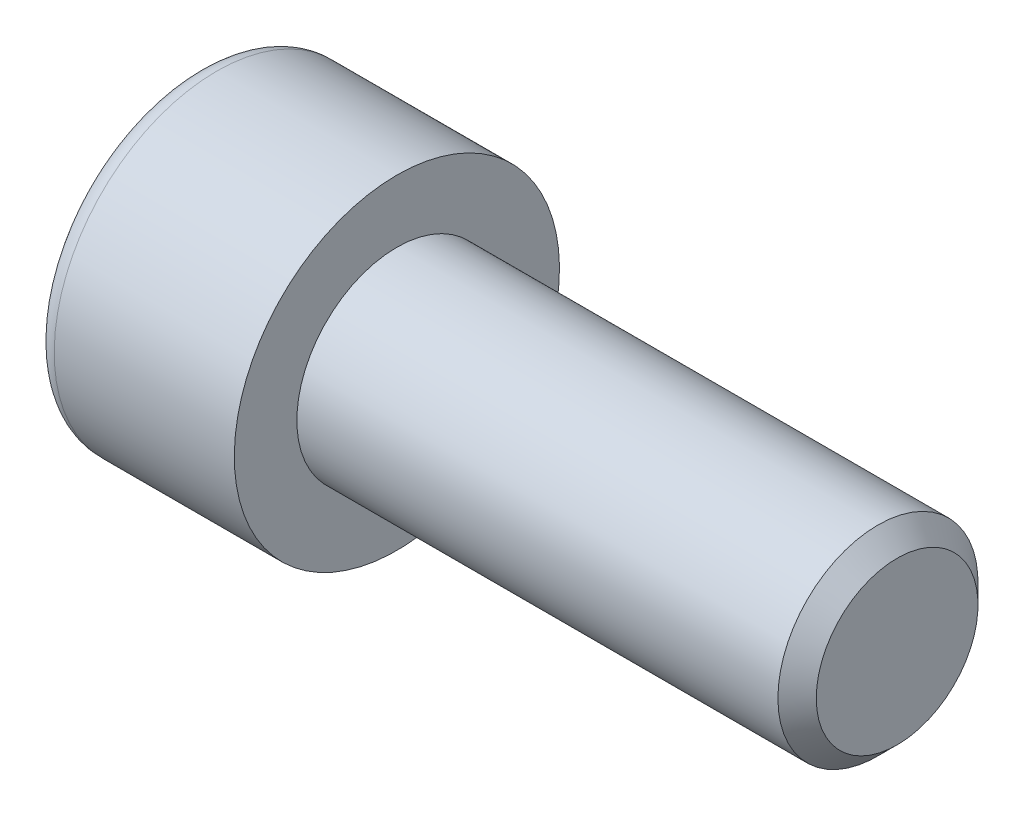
ISO-10303-21;
HEADER;
FILE_DESCRIPTION(('STEP AP214'),'2;1');
FILE_NAME('part.step','',(''),(''),'','','');
FILE_SCHEMA(('AUTOMOTIVE_DESIGN { 1 0 10303 214 1 1 1 1 }'));
ENDSEC;
DATA;
#1=APPLICATION_CONTEXT('core data for automotive mechanical design processes');
#2=APPLICATION_PROTOCOL_DEFINITION('international standard','automotive_design',2000,#1);
#3=PRODUCT_CONTEXT('',#1,'mechanical');
#4=PRODUCT('Part','Part','',(#3));
#5=PRODUCT_RELATED_PRODUCT_CATEGORY('part','',(#4));
#6=PRODUCT_DEFINITION_FORMATION('','',#4);
#7=PRODUCT_DEFINITION_CONTEXT('part definition',#1,'design');
#8=PRODUCT_DEFINITION('design','',#6,#7);
#9=PRODUCT_DEFINITION_SHAPE('','',#8);
#10=(LENGTH_UNIT() NAMED_UNIT(*) SI_UNIT(.MILLI.,.METRE.));
#11=(NAMED_UNIT(*) PLANE_ANGLE_UNIT() SI_UNIT($,.RADIAN.));
#12=(NAMED_UNIT(*) SI_UNIT($,.STERADIAN.) SOLID_ANGLE_UNIT());
#13=UNCERTAINTY_MEASURE_WITH_UNIT(LENGTH_MEASURE(1.E-05),#10,'distance_accuracy_value','');
#14=(GEOMETRIC_REPRESENTATION_CONTEXT(3) GLOBAL_UNCERTAINTY_ASSIGNED_CONTEXT((#13)) GLOBAL_UNIT_ASSIGNED_CONTEXT((#10,
#11,#12)) REPRESENTATION_CONTEXT('',''));
#15=CARTESIAN_POINT('',(0.,0.,0.));
#16=DIRECTION('',(0.,0.,1.));
#17=DIRECTION('',(1.,0.,0.));
#18=AXIS2_PLACEMENT_3D('',#15,#16,#17);
#19=CARTESIAN_POINT('',(-1.99999999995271,0.,0.));
#20=DIRECTION('',(-1.,0.,0.));
#21=DIRECTION('',(0.,0.,1.));
#22=AXIS2_PLACEMENT_3D('',#19,#20,#21);
#23=CONICAL_SURFACE('',#22,0.,1.04719755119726);
#24=CARTESIAN_POINT('',(-1.99999999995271,0.,0.));
#25=VERTEX_POINT('',#24);
#26=VERTEX_LOOP('',#25);
#27=FACE_BOUND('',#26,.T.);
#28=CARTESIAN_POINT('',(-3.99999999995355,1.16431272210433E-11,-3.46410161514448));
#29=CARTESIAN_POINT('',(-3.95604331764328,-0.1318318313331,-3.38798847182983));
#30=CARTESIAN_POINT('',(-3.91606701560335,-0.264801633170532,-3.3112183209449));
#31=CARTESIAN_POINT('',(-3.84628958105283,-0.533043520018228,-3.15634879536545));
#32=CARTESIAN_POINT('',(-3.81651313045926,-0.668320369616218,-3.07824666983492));
#33=CARTESIAN_POINT('',(-3.7701639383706,-0.937197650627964,-2.92301029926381));
#34=CARTESIAN_POINT('',(-3.75328268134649,-1.07075672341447,-2.84589993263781));
#35=CARTESIAN_POINT('',(-3.73313375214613,-1.33850298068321,-2.69131655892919));
#36=CARTESIAN_POINT('',(-3.72984939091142,-1.47268919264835,-2.61384411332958));
#37=CARTESIAN_POINT('',(-3.73669943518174,-1.72340173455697,-2.46909515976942));
#38=CARTESIAN_POINT('',(-3.74515192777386,-1.83996568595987,-2.40179693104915));
#39=CARTESIAN_POINT('',(-3.77193595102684,-2.0723342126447,-2.26763889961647));
#40=CARTESIAN_POINT('',(-3.79027662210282,-2.18813798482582,-2.20077956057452));
#41=CARTESIAN_POINT('',(-3.83612474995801,-2.4209852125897,-2.06634515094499));
#42=CARTESIAN_POINT('',(-3.86382646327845,-2.53799921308,-1.99878708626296));
#43=CARTESIAN_POINT('',(-3.92669764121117,-2.77028245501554,-1.86467829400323));
#44=CARTESIAN_POINT('',(-3.96185234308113,-2.88555466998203,-1.79812584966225));
#45=CARTESIAN_POINT('',(-3.99999999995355,-3.00000000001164,-1.73205080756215));
#46=B_SPLINE_CURVE_WITH_KNOTS('',3,(#28,#29,#30,#31,#32,#33,#34,#35,#36,#37,#38,#39,#40,#41,#42,
#43,#44,#45),.UNSPECIFIED.,.F.,.F.,(4,2,2,2,2,2,2,2,4),(0.,0.475524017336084,0.952190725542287,
1.41706140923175,1.88136133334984,2.28556167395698,2.69013629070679,3.10368243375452,
3.51641696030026),.UNSPECIFIED.);
#47=CARTESIAN_POINT('',(-3.99999999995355,0.,-3.46410161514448));
#48=VERTEX_POINT('',#47);
#49=CARTESIAN_POINT('',(-3.99999999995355,-3.00000000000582,-1.73205080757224));
#50=VERTEX_POINT('',#49);
#51=EDGE_CURVE('E111',#48,#50,#46,.T.);
#52=ORIENTED_EDGE('',*,*,#51,.T.);
#53=CARTESIAN_POINT('',(-3.99999999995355,-3.,-1.73205080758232));
#54=CARTESIAN_POINT('',(-3.95895066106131,-3.,-1.58986661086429));
#55=CARTESIAN_POINT('',(-3.92136883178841,-3.,-1.44655761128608));
#56=CARTESIAN_POINT('',(-3.85494761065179,-3.,-1.15761165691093));
#57=CARTESIAN_POINT('',(-3.82612777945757,-3.,-1.01197024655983));
#58=CARTESIAN_POINT('',(-3.77978200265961,-3.,-0.722321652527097));
#59=CARTESIAN_POINT('',(-3.76200896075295,-3.,-0.57835524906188));
#60=CARTESIAN_POINT('',(-3.73814970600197,-3.,-0.289591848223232));
#61=CARTESIAN_POINT('',(-3.73205080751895,-3.,-0.144795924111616));
#62=CARTESIAN_POINT('',(-3.73205080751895,-3.,0.144795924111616));
#63=CARTESIAN_POINT('',(-3.73814970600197,-3.,0.289591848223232));
#64=CARTESIAN_POINT('',(-3.76200896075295,-3.,0.57835524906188));
#65=CARTESIAN_POINT('',(-3.77978200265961,-3.,0.722321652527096));
#66=CARTESIAN_POINT('',(-3.82612777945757,-3.,1.01197024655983));
#67=CARTESIAN_POINT('',(-3.85494761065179,-3.,1.15761165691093));
#68=CARTESIAN_POINT('',(-3.92136883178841,-3.,1.44655761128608));
#69=CARTESIAN_POINT('',(-3.95895066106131,-3.,1.58986661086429));
#70=CARTESIAN_POINT('',(-3.99999999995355,-3.,1.73205080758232));
#71=B_SPLINE_CURVE_WITH_KNOTS('',3,(#53,#54,#55,#56,#57,#58,#59,#60,#61,#62,#63,#64,#65,#66,#67,
#68,#69,#70),.UNSPECIFIED.,.F.,.F.,(4,2,2,2,2,2,2,2,4),(0.,0.444110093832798,0.88920447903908,
1.32394628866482,1.7582154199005,2.19248455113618,2.62722636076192,3.07232074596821,
3.516430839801),.UNSPECIFIED.);
#72=CARTESIAN_POINT('',(-3.99999999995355,-3.00000000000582,1.73205080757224));
#73=VERTEX_POINT('',#72);
#74=EDGE_CURVE('E106',#50,#73,#71,.T.);
#75=ORIENTED_EDGE('',*,*,#74,.T.);
#76=CARTESIAN_POINT('',(-3.99999999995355,-3.00000000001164,1.73205080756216));
#77=CARTESIAN_POINT('',(-3.95604331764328,-2.8681681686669,1.8081639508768));
#78=CARTESIAN_POINT('',(-3.91606701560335,-2.73519836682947,1.88493410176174));
#79=CARTESIAN_POINT('',(-3.84628958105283,-2.46695647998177,2.03980362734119));
#80=CARTESIAN_POINT('',(-3.81651313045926,-2.33167963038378,2.11790575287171));
#81=CARTESIAN_POINT('',(-3.7701639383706,-2.06280234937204,2.27314212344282));
#82=CARTESIAN_POINT('',(-3.75328268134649,-1.92924327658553,2.35025249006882));
#83=CARTESIAN_POINT('',(-3.73313375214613,-1.6614970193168,2.50483586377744));
#84=CARTESIAN_POINT('',(-3.72984939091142,-1.52731080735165,2.58230830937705));
#85=CARTESIAN_POINT('',(-3.73669943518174,-1.27659826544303,2.72705726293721));
#86=CARTESIAN_POINT('',(-3.74515192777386,-1.16003431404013,2.79435549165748));
#87=CARTESIAN_POINT('',(-3.77193595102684,-0.927665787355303,2.92851352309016));
#88=CARTESIAN_POINT('',(-3.79027662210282,-0.811862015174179,2.99537286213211));
#89=CARTESIAN_POINT('',(-3.83612474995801,-0.5790147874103,3.12980727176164));
#90=CARTESIAN_POINT('',(-3.86382646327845,-0.462000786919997,3.19736533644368));
#91=CARTESIAN_POINT('',(-3.92669764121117,-0.22971754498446,3.3314741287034));
#92=CARTESIAN_POINT('',(-3.96185234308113,-0.114445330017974,3.39802657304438));
#93=CARTESIAN_POINT('',(-3.99999999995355,1.16435634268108E-11,3.46410161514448));
#94=B_SPLINE_CURVE_WITH_KNOTS('',3,(#76,#77,#78,#79,#80,#81,#82,#83,#84,#85,#86,#87,#88,#89,#90,
#91,#92,#93),.UNSPECIFIED.,.F.,.F.,(4,2,2,2,2,2,2,2,4),(0.,0.475524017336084,0.952190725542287,
1.41706140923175,1.88136133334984,2.28556167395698,2.69013629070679,3.10368243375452,
3.51641696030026),.UNSPECIFIED.);
#95=CARTESIAN_POINT('',(-3.99999999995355,0.,3.46410161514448));
#96=VERTEX_POINT('',#95);
#97=EDGE_CURVE('E89',#73,#96,#94,.T.);
#98=ORIENTED_EDGE('',*,*,#97,.T.);
#99=CARTESIAN_POINT('',(-3.99999999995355,-1.1643732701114E-11,3.46410161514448));
#100=CARTESIAN_POINT('',(-3.95604331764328,0.131831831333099,3.38798847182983));
#101=CARTESIAN_POINT('',(-3.91606701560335,0.264801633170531,3.3112183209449));
#102=CARTESIAN_POINT('',(-3.84628958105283,0.533043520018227,3.15634879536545));
#103=CARTESIAN_POINT('',(-3.81651313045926,0.668320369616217,3.07824666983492));
#104=CARTESIAN_POINT('',(-3.7701639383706,0.937197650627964,2.92301029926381));
#105=CARTESIAN_POINT('',(-3.75328268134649,1.07075672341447,2.84589993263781));
#106=CARTESIAN_POINT('',(-3.73313375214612,1.3385029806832,2.69131655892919));
#107=CARTESIAN_POINT('',(-3.72984939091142,1.47268919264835,2.61384411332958));
#108=CARTESIAN_POINT('',(-3.73669943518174,1.72340173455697,2.46909515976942));
#109=CARTESIAN_POINT('',(-3.74515192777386,1.83996568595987,2.40179693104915));
#110=CARTESIAN_POINT('',(-3.77193595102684,2.0723342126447,2.26763889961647));
#111=CARTESIAN_POINT('',(-3.79027662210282,2.18813798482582,2.20077956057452));
#112=CARTESIAN_POINT('',(-3.83612474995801,2.4209852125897,2.06634515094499));
#113=CARTESIAN_POINT('',(-3.86382646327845,2.53799921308,1.99878708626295));
#114=CARTESIAN_POINT('',(-3.92669764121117,2.77028245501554,1.86467829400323));
#115=CARTESIAN_POINT('',(-3.96185234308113,2.88555466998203,1.79812584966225));
#116=CARTESIAN_POINT('',(-3.99999999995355,3.00000000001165,1.73205080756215));
#117=B_SPLINE_CURVE_WITH_KNOTS('',3,(#99,#100,#101,#102,#103,#104,#105,#106,#107,#108,#109,#110,
#111,#112,#113,#114,#115,#116),.UNSPECIFIED.,.F.,.F.,(4,2,2,2,2,2,2,2,4),(0.,0.475524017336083,
0.952190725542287,1.41706140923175,1.88136133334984,2.28556167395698,2.69013629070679,
3.10368243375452,3.51641696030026),.UNSPECIFIED.);
#118=CARTESIAN_POINT('',(-3.99999999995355,3.00000000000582,1.73205080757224));
#119=VERTEX_POINT('',#118);
#120=EDGE_CURVE('E86',#96,#119,#117,.T.);
#121=ORIENTED_EDGE('',*,*,#120,.T.);
#122=CARTESIAN_POINT('',(-3.99999999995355,3.,1.73205080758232));
#123=CARTESIAN_POINT('',(-3.95895066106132,3.,1.58986661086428));
#124=CARTESIAN_POINT('',(-3.92136883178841,3.,1.44655761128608));
#125=CARTESIAN_POINT('',(-3.85494761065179,3.,1.15761165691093));
#126=CARTESIAN_POINT('',(-3.82612777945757,3.,1.01197024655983));
#127=CARTESIAN_POINT('',(-3.77978200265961,3.,0.722321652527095));
#128=CARTESIAN_POINT('',(-3.76200896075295,3.,0.578355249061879));
#129=CARTESIAN_POINT('',(-3.73814970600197,3.,0.289591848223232));
#130=CARTESIAN_POINT('',(-3.73205080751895,3.,0.144795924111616));
#131=CARTESIAN_POINT('',(-3.73205080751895,3.,-0.144795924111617));
#132=CARTESIAN_POINT('',(-3.73814970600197,3.,-0.289591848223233));
#133=CARTESIAN_POINT('',(-3.76200896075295,3.,-0.578355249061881));
#134=CARTESIAN_POINT('',(-3.77978200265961,3.,-0.722321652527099));
#135=CARTESIAN_POINT('',(-3.82612777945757,3.,-1.01197024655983));
#136=CARTESIAN_POINT('',(-3.85494761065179,3.,-1.15761165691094));
#137=CARTESIAN_POINT('',(-3.92136883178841,3.,-1.44655761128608));
#138=CARTESIAN_POINT('',(-3.95895066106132,3.,-1.58986661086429));
#139=CARTESIAN_POINT('',(-3.99999999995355,3.,-1.73205080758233));
#140=B_SPLINE_CURVE_WITH_KNOTS('',3,(#122,#123,#124,#125,#126,#127,#128,#129,#130,#131,#132,
#133,#134,#135,#136,#137,#138,#139),.UNSPECIFIED.,.F.,.F.,(4,2,2,2,2,2,2,2,4),(0.,
0.444110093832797,0.889204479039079,1.32394628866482,1.7582154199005,2.19248455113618,
2.62722636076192,3.07232074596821,3.51643083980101),.UNSPECIFIED.);
#141=CARTESIAN_POINT('',(-3.99999999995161,3.,-1.7320508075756));
#142=VERTEX_POINT('',#141);
#143=EDGE_CURVE('E20',#119,#142,#140,.T.);
#144=ORIENTED_EDGE('',*,*,#143,.T.);
#145=CARTESIAN_POINT('',(-3.99999999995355,3.00000000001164,-1.73205080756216));
#146=CARTESIAN_POINT('',(-3.95604331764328,2.8681681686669,-1.80816395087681));
#147=CARTESIAN_POINT('',(-3.91606701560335,2.73519836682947,-1.88493410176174));
#148=CARTESIAN_POINT('',(-3.84628958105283,2.46695647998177,-2.03980362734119));
#149=CARTESIAN_POINT('',(-3.81651313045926,2.33167963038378,-2.11790575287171));
#150=CARTESIAN_POINT('',(-3.7701639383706,2.06280234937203,-2.27314212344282));
#151=CARTESIAN_POINT('',(-3.75328268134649,1.92924327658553,-2.35025249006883));
#152=CARTESIAN_POINT('',(-3.73313375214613,1.66149701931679,-2.50483586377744));
#153=CARTESIAN_POINT('',(-3.72984939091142,1.52731080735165,-2.58230830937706));
#154=CARTESIAN_POINT('',(-3.73669943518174,1.27659826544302,-2.72705726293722));
#155=CARTESIAN_POINT('',(-3.74515192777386,1.16003431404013,-2.79435549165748));
#156=CARTESIAN_POINT('',(-3.77193595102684,0.927665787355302,-2.92851352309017));
#157=CARTESIAN_POINT('',(-3.79027662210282,0.811862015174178,-2.99537286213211));
#158=CARTESIAN_POINT('',(-3.83612474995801,0.5790147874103,-3.12980727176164));
#159=CARTESIAN_POINT('',(-3.86382646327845,0.462000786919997,-3.19736533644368));
#160=CARTESIAN_POINT('',(-3.92669764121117,0.229717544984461,-3.3314741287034));
#161=CARTESIAN_POINT('',(-3.96185234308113,0.114445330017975,-3.39802657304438));
#162=CARTESIAN_POINT('',(-3.99999999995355,-1.1642871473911E-11,-3.46410161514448));
#163=B_SPLINE_CURVE_WITH_KNOTS('',3,(#145,#146,#147,#148,#149,#150,#151,#152,#153,#154,#155,
#156,#157,#158,#159,#160,#161,#162),.UNSPECIFIED.,.F.,.F.,(4,2,2,2,2,2,2,2,4),(0.,
0.475524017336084,0.952190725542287,1.41706140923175,1.88136133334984,2.28556167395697,
2.69013629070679,3.10368243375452,3.51641696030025),.UNSPECIFIED.);
#164=EDGE_CURVE('E115',#142,#48,#163,.T.);
#165=ORIENTED_EDGE('',*,*,#164,.T.);
#166=EDGE_LOOP('',(#52,#75,#98,#121,#144,#165));
#167=FACE_BOUND('',#166,.T.);
#168=ADVANCED_FACE('F16',(#27,#167),#23,.F.);
#169=CARTESIAN_POINT('',(-8.,3.,1.73205080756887));
#170=DIRECTION('',(0.,1.,0.));
#171=DIRECTION('',(0.,0.,1.));
#172=AXIS2_PLACEMENT_3D('',#169,#170,#171);
#173=PLANE('',#172);
#174=DIRECTION('',(1.,0.,0.));
#175=VECTOR('',#174,1.);
#176=CARTESIAN_POINT('',(-8.,3.,1.73205080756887));
#177=LINE('',#176,#175);
#178=CARTESIAN_POINT('',(-8.,3.,1.73205080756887));
#179=VERTEX_POINT('',#178);
#180=EDGE_CURVE('E78',#119,#179,#177,.F.);
#181=ORIENTED_EDGE('',*,*,#180,.T.);
#182=DIRECTION('',(0.,0.,1.));
#183=VECTOR('',#182,1.);
#184=CARTESIAN_POINT('',(-8.,3.,0.));
#185=LINE('',#184,#183);
#186=CARTESIAN_POINT('',(-8.,3.,-1.73205080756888));
#187=VERTEX_POINT('',#186);
#188=EDGE_CURVE('E158',#187,#179,#185,.T.);
#189=ORIENTED_EDGE('',*,*,#188,.F.);
#190=DIRECTION('',(1.,0.,0.));
#191=VECTOR('',#190,1.);
#192=CARTESIAN_POINT('',(-8.,3.,-1.73205080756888));
#193=LINE('',#192,#191);
#194=EDGE_CURVE('E81',#187,#142,#193,.T.);
#195=ORIENTED_EDGE('',*,*,#194,.T.);
#196=ORIENTED_EDGE('',*,*,#143,.F.);
#197=EDGE_LOOP('',(#181,#189,#195,#196));
#198=FACE_BOUND('',#197,.T.);
#199=ADVANCED_FACE('F75',(#198),#173,.F.);
#200=CARTESIAN_POINT('',(-8.,0.,3.46410161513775));
#201=DIRECTION('',(0.,0.5,0.866025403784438));
#202=DIRECTION('',(0.,-0.866025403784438,0.5));
#203=AXIS2_PLACEMENT_3D('',#200,#201,#202);
#204=PLANE('',#203);
#205=DIRECTION('',(1.,0.,0.));
#206=VECTOR('',#205,1.);
#207=CARTESIAN_POINT('',(-8.,0.,3.46410161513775));
#208=LINE('',#207,#206);
#209=CARTESIAN_POINT('',(-8.,0.,3.46410161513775));
#210=VERTEX_POINT('',#209);
#211=EDGE_CURVE('E92',#96,#210,#208,.F.);
#212=ORIENTED_EDGE('',*,*,#211,.T.);
#213=DIRECTION('',(0.,-0.866025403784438,0.500000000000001));
#214=VECTOR('',#213,1.);
#215=CARTESIAN_POINT('',(-8.,3.,1.73205080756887));
#216=LINE('',#215,#214);
#217=EDGE_CURVE('E95',#179,#210,#216,.T.);
#218=ORIENTED_EDGE('',*,*,#217,.F.);
#219=ORIENTED_EDGE('',*,*,#180,.F.);
#220=ORIENTED_EDGE('',*,*,#120,.F.);
#221=EDGE_LOOP('',(#212,#218,#219,#220));
#222=FACE_BOUND('',#221,.T.);
#223=ADVANCED_FACE('F93',(#222),#204,.F.);
#224=CARTESIAN_POINT('',(-8.,-3.,1.73205080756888));
#225=DIRECTION('',(0.,-0.5,0.866025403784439));
#226=DIRECTION('',(0.,-0.866025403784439,-0.5));
#227=AXIS2_PLACEMENT_3D('',#224,#225,#226);
#228=PLANE('',#227);
#229=DIRECTION('',(1.,0.,0.));
#230=VECTOR('',#229,1.);
#231=CARTESIAN_POINT('',(-8.,-3.,1.73205080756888));
#232=LINE('',#231,#230);
#233=CARTESIAN_POINT('',(-8.,-3.,1.73205080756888));
#234=VERTEX_POINT('',#233);
#235=EDGE_CURVE('E104',#73,#234,#232,.F.);
#236=ORIENTED_EDGE('',*,*,#235,.T.);
#237=DIRECTION('',(0.,-0.866025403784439,-0.5));
#238=VECTOR('',#237,1.);
#239=CARTESIAN_POINT('',(-8.,0.,3.46410161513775));
#240=LINE('',#239,#238);
#241=EDGE_CURVE('E180',#210,#234,#240,.T.);
#242=ORIENTED_EDGE('',*,*,#241,.F.);
#243=ORIENTED_EDGE('',*,*,#211,.F.);
#244=ORIENTED_EDGE('',*,*,#97,.F.);
#245=EDGE_LOOP('',(#236,#242,#243,#244));
#246=FACE_BOUND('',#245,.T.);
#247=ADVANCED_FACE('F229',(#246),#228,.F.);
#248=CARTESIAN_POINT('',(-8.,-3.,-1.73205080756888));
#249=DIRECTION('',(0.,-1.,0.));
#250=DIRECTION('',(0.,0.,-1.));
#251=AXIS2_PLACEMENT_3D('',#248,#249,#250);
#252=PLANE('',#251);
#253=DIRECTION('',(1.,0.,0.));
#254=VECTOR('',#253,1.);
#255=CARTESIAN_POINT('',(-8.,-3.,-1.73205080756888));
#256=LINE('',#255,#254);
#257=CARTESIAN_POINT('',(-8.,-3.,-1.73205080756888));
#258=VERTEX_POINT('',#257);
#259=EDGE_CURVE('E109',#50,#258,#256,.F.);
#260=ORIENTED_EDGE('',*,*,#259,.T.);
#261=DIRECTION('',(0.,0.,1.));
#262=VECTOR('',#261,1.);
#263=CARTESIAN_POINT('',(-8.,-3.,0.));
#264=LINE('',#263,#262);
#265=EDGE_CURVE('E175',#234,#258,#264,.F.);
#266=ORIENTED_EDGE('',*,*,#265,.F.);
#267=ORIENTED_EDGE('',*,*,#235,.F.);
#268=ORIENTED_EDGE('',*,*,#74,.F.);
#269=EDGE_LOOP('',(#260,#266,#267,#268));
#270=FACE_BOUND('',#269,.T.);
#271=ADVANCED_FACE('F232',(#270),#252,.F.);
#272=CARTESIAN_POINT('',(-8.,0.,-3.46410161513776));
#273=DIRECTION('',(0.,-0.5,-0.866025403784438));
#274=DIRECTION('',(0.,0.866025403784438,-0.5));
#275=AXIS2_PLACEMENT_3D('',#272,#273,#274);
#276=PLANE('',#275);
#277=DIRECTION('',(1.,0.,0.));
#278=VECTOR('',#277,1.);
#279=CARTESIAN_POINT('',(-8.,0.,-3.46410161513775));
#280=LINE('',#279,#278);
#281=CARTESIAN_POINT('',(-8.,0.,-3.46410161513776));
#282=VERTEX_POINT('',#281);
#283=EDGE_CURVE('E40',#48,#282,#280,.F.);
#284=ORIENTED_EDGE('',*,*,#283,.T.);
#285=DIRECTION('',(0.,0.866025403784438,-0.5));
#286=VECTOR('',#285,1.);
#287=CARTESIAN_POINT('',(-8.,-3.,-1.73205080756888));
#288=LINE('',#287,#286);
#289=EDGE_CURVE('E170',#258,#282,#288,.T.);
#290=ORIENTED_EDGE('',*,*,#289,.F.);
#291=ORIENTED_EDGE('',*,*,#259,.F.);
#292=ORIENTED_EDGE('',*,*,#51,.F.);
#293=EDGE_LOOP('',(#284,#290,#291,#292));
#294=FACE_BOUND('',#293,.T.);
#295=ADVANCED_FACE('F236',(#294),#276,.F.);
#296=CARTESIAN_POINT('',(-8.,3.,-1.73205080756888));
#297=DIRECTION('',(0.,0.5,-0.866025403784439));
#298=DIRECTION('',(0.,0.866025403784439,0.5));
#299=AXIS2_PLACEMENT_3D('',#296,#297,#298);
#300=PLANE('',#299);
#301=ORIENTED_EDGE('',*,*,#194,.F.);
#302=DIRECTION('',(0.,0.866025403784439,0.5));
#303=VECTOR('',#302,1.);
#304=CARTESIAN_POINT('',(-8.,0.,-3.46410161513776));
#305=LINE('',#304,#303);
#306=EDGE_CURVE('E167',#282,#187,#305,.T.);
#307=ORIENTED_EDGE('',*,*,#306,.F.);
#308=ORIENTED_EDGE('',*,*,#283,.F.);
#309=ORIENTED_EDGE('',*,*,#164,.F.);
#310=EDGE_LOOP('',(#301,#307,#308,#309));
#311=FACE_BOUND('',#310,.T.);
#312=ADVANCED_FACE('F143',(#311),#300,.F.);
#313=CARTESIAN_POINT('',(-8.,4.98205080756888,0.));
#314=DIRECTION('',(-1.,0.,0.));
#315=DIRECTION('',(0.,-1.,0.));
#316=AXIS2_PLACEMENT_3D('',#313,#314,#315);
#317=PLANE('',#316);
#318=CARTESIAN_POINT('',(-7.99999999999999,0.,0.));
#319=DIRECTION('',(1.,0.,0.));
#320=DIRECTION('',(0.,1.,0.));
#321=AXIS2_PLACEMENT_3D('',#318,#319,#320);
#322=CIRCLE('',#321,5.7);
#323=CARTESIAN_POINT('',(-7.99999999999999,5.7,0.));
#324=VERTEX_POINT('',#323);
#325=EDGE_CURVE('E125',#324,#324,#322,.T.);
#326=ORIENTED_EDGE('',*,*,#325,.F.);
#327=EDGE_LOOP('',(#326));
#328=FACE_BOUND('',#327,.T.);
#329=ORIENTED_EDGE('',*,*,#289,.T.);
#330=ORIENTED_EDGE('',*,*,#306,.T.);
#331=ORIENTED_EDGE('',*,*,#188,.T.);
#332=ORIENTED_EDGE('',*,*,#217,.T.);
#333=ORIENTED_EDGE('',*,*,#241,.T.);
#334=ORIENTED_EDGE('',*,*,#265,.T.);
#335=EDGE_LOOP('',(#329,#330,#331,#332,#333,#334));
#336=FACE_BOUND('',#335,.T.);
#337=ADVANCED_FACE('F132',(#328,#336),#317,.T.);
#338=CARTESIAN_POINT('',(-7.2,0.,0.));
#339=DIRECTION('',(1.,0.,0.));
#340=DIRECTION('',(0.,0.,-1.));
#341=AXIS2_PLACEMENT_3D('',#338,#339,#340);
#342=TOROIDAL_SURFACE('',#341,5.7,0.8);
#343=CARTESIAN_POINT('',(-7.2,0.,0.));
#344=DIRECTION('',(1.,0.,0.));
#345=DIRECTION('',(0.,1.,0.));
#346=AXIS2_PLACEMENT_3D('',#343,#344,#345);
#347=CIRCLE('',#346,6.5);
#348=CARTESIAN_POINT('',(-7.2,6.5,0.));
#349=VERTEX_POINT('',#348);
#350=EDGE_CURVE('E196',#349,#349,#347,.T.);
#351=ORIENTED_EDGE('',*,*,#350,.F.);
#352=EDGE_LOOP('',(#351));
#353=FACE_BOUND('',#352,.T.);
#354=ORIENTED_EDGE('',*,*,#325,.T.);
#355=EDGE_LOOP('',(#354));
#356=FACE_BOUND('',#355,.T.);
#357=ADVANCED_FACE('F142',(#353,#356),#342,.T.);
#358=CARTESIAN_POINT('',(20.,2.,0.));
#359=DIRECTION('',(1.,0.,0.));
#360=DIRECTION('',(0.,1.,0.));
#361=AXIS2_PLACEMENT_3D('',#358,#359,#360);
#362=PLANE('',#361);
#363=CARTESIAN_POINT('',(19.9999999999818,0.,0.));
#364=DIRECTION('',(-1.,0.,0.));
#365=DIRECTION('',(0.,0.,1.));
#366=AXIS2_PLACEMENT_3D('',#363,#364,#365);
#367=CIRCLE('',#366,3.23318750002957);
#368=CARTESIAN_POINT('',(19.9999999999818,0.,3.23318750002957));
#369=VERTEX_POINT('',#368);
#370=EDGE_CURVE('E193',#369,#369,#367,.T.);
#371=ORIENTED_EDGE('',*,*,#370,.F.);
#372=EDGE_LOOP('',(#371));
#373=FACE_BOUND('',#372,.T.);
#374=ADVANCED_FACE('F149',(#373),#362,.T.);
#375=CARTESIAN_POINT('',(-4.,0.,0.));
#376=DIRECTION('',(1.,0.,0.));
#377=DIRECTION('',(0.,1.,0.));
#378=AXIS2_PLACEMENT_3D('',#375,#376,#377);
#379=CYLINDRICAL_SURFACE('',#378,6.5);
#380=CARTESIAN_POINT('',(0.,0.,0.));
#381=DIRECTION('',(1.,0.,0.));
#382=DIRECTION('',(0.,1.,0.));
#383=AXIS2_PLACEMENT_3D('',#380,#381,#382);
#384=CIRCLE('',#383,6.5);
#385=CARTESIAN_POINT('',(0.,6.5,0.));
#386=VERTEX_POINT('',#385);
#387=EDGE_CURVE('E190',#386,#386,#384,.T.);
#388=ORIENTED_EDGE('',*,*,#387,.F.);
#389=EDGE_LOOP('',(#388));
#390=FACE_BOUND('',#389,.T.);
#391=ORIENTED_EDGE('',*,*,#350,.T.);
#392=EDGE_LOOP('',(#391));
#393=FACE_BOUND('',#392,.T.);
#394=ADVANCED_FACE('F263',(#390,#393),#379,.T.);
#395=CARTESIAN_POINT('',(19.2331874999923,0.,0.));
#396=DIRECTION('',(-1.,0.,0.));
#397=DIRECTION('',(0.,0.,1.));
#398=AXIS2_PLACEMENT_3D('',#395,#396,#397);
#399=CONICAL_SURFACE('',#398,4.0000000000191,0.785398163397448);
#400=CARTESIAN_POINT('',(19.2331875,0.,0.));
#401=DIRECTION('',(1.,0.,0.));
#402=DIRECTION('',(0.,1.,0.));
#403=AXIS2_PLACEMENT_3D('',#400,#401,#402);
#404=CIRCLE('',#403,4.);
#405=CARTESIAN_POINT('',(19.2331875,4.,0.));
#406=VERTEX_POINT('',#405);
#407=EDGE_CURVE('E31',#406,#406,#404,.F.);
#408=ORIENTED_EDGE('',*,*,#407,.F.);
#409=EDGE_LOOP('',(#408));
#410=FACE_BOUND('',#409,.T.);
#411=ORIENTED_EDGE('',*,*,#370,.T.);
#412=EDGE_LOOP('',(#411));
#413=FACE_BOUND('',#412,.T.);
#414=ADVANCED_FACE('F251',(#410,#413),#399,.T.);
#415=CARTESIAN_POINT('',(0.,5.25,0.));
#416=DIRECTION('',(1.,0.,0.));
#417=DIRECTION('',(0.,1.,0.));
#418=AXIS2_PLACEMENT_3D('',#415,#416,#417);
#419=PLANE('',#418);
#420=ORIENTED_EDGE('',*,*,#387,.T.);
#421=EDGE_LOOP('',(#420));
#422=FACE_BOUND('',#421,.T.);
#423=CARTESIAN_POINT('',(0.,0.,0.));
#424=DIRECTION('',(1.,0.,0.));
#425=DIRECTION('',(0.,1.,0.));
#426=AXIS2_PLACEMENT_3D('',#423,#424,#425);
#427=CIRCLE('',#426,4.);
#428=CARTESIAN_POINT('',(0.,4.,0.));
#429=VERTEX_POINT('',#428);
#430=EDGE_CURVE('E10',#429,#429,#427,.T.);
#431=ORIENTED_EDGE('',*,*,#430,.F.);
#432=EDGE_LOOP('',(#431));
#433=FACE_BOUND('',#432,.T.);
#434=ADVANCED_FACE('F246',(#422,#433),#419,.T.);
#435=CARTESIAN_POINT('',(11.5625,0.,0.));
#436=DIRECTION('',(1.,0.,0.));
#437=DIRECTION('',(0.,1.,0.));
#438=AXIS2_PLACEMENT_3D('',#435,#436,#437);
#439=CYLINDRICAL_SURFACE('',#438,4.);
#440=ORIENTED_EDGE('',*,*,#407,.T.);
#441=EDGE_LOOP('',(#440));
#442=FACE_BOUND('',#441,.T.);
#443=ORIENTED_EDGE('',*,*,#430,.T.);
#444=EDGE_LOOP('',(#443));
#445=FACE_BOUND('',#444,.T.);
#446=ADVANCED_FACE('F18',(#442,#445),#439,.T.);
#447=CLOSED_SHELL('',(#168,#199,#223,#247,#271,#295,#312,#337,#357,#374,#394,#414,#434,#446));
#448=MANIFOLD_SOLID_BREP('B1',#447);
#449=ADVANCED_BREP_SHAPE_REPRESENTATION('',(#18,#448),#14);
#450=SHAPE_DEFINITION_REPRESENTATION(#9,#449);
ENDSEC;
END-ISO-10303-21;
